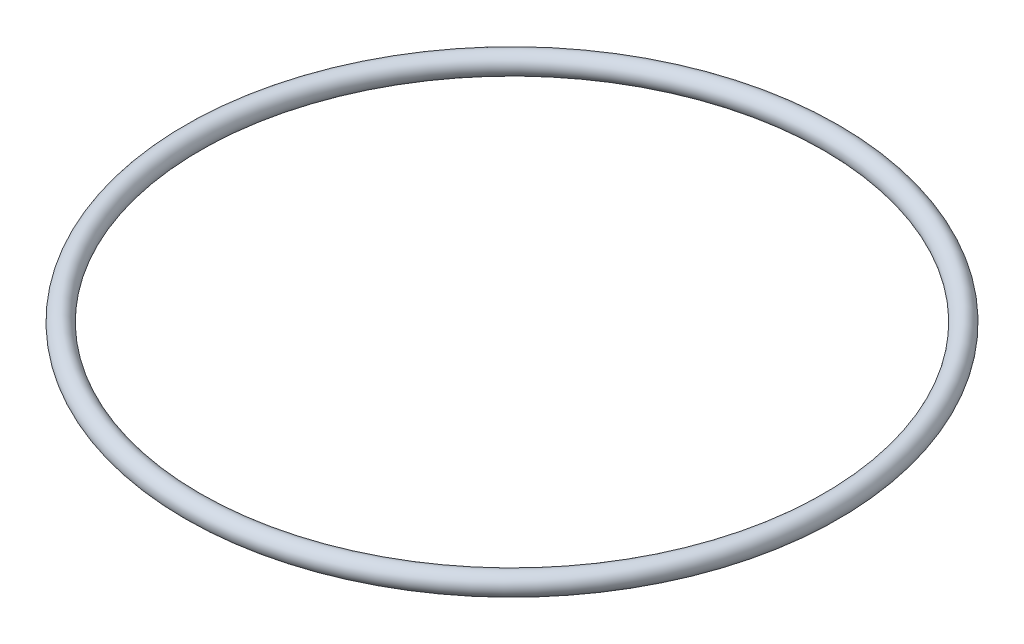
ISO-10303-21;
HEADER;
FILE_DESCRIPTION(('STEP AP214'),'2;1');
FILE_NAME('part.step','',(''),(''),'','','');
FILE_SCHEMA(('AUTOMOTIVE_DESIGN { 1 0 10303 214 1 1 1 1 }'));
ENDSEC;
DATA;
#1=APPLICATION_CONTEXT('core data for automotive mechanical design processes');
#2=APPLICATION_PROTOCOL_DEFINITION('international standard','automotive_design',2000,#1);
#3=PRODUCT_CONTEXT('',#1,'mechanical');
#4=PRODUCT('Part','Part','',(#3));
#5=PRODUCT_RELATED_PRODUCT_CATEGORY('part','',(#4));
#6=PRODUCT_DEFINITION_FORMATION('','',#4);
#7=PRODUCT_DEFINITION_CONTEXT('part definition',#1,'design');
#8=PRODUCT_DEFINITION('design','',#6,#7);
#9=PRODUCT_DEFINITION_SHAPE('','',#8);
#10=(LENGTH_UNIT() NAMED_UNIT(*) SI_UNIT(.MILLI.,.METRE.));
#11=(NAMED_UNIT(*) PLANE_ANGLE_UNIT() SI_UNIT($,.RADIAN.));
#12=(NAMED_UNIT(*) SI_UNIT($,.STERADIAN.) SOLID_ANGLE_UNIT());
#13=UNCERTAINTY_MEASURE_WITH_UNIT(LENGTH_MEASURE(1.E-05),#10,'distance_accuracy_value','');
#14=(GEOMETRIC_REPRESENTATION_CONTEXT(3) GLOBAL_UNCERTAINTY_ASSIGNED_CONTEXT((#13)) GLOBAL_UNIT_ASSIGNED_CONTEXT((#10,
#11,#12)) REPRESENTATION_CONTEXT('',''));
#15=CARTESIAN_POINT('',(0.,0.,0.));
#16=DIRECTION('',(0.,0.,1.));
#17=DIRECTION('',(1.,0.,0.));
#18=AXIS2_PLACEMENT_3D('',#15,#16,#17);
#19=CARTESIAN_POINT('',(0.,0.,0.));
#20=DIRECTION('',(0.,-1.,0.));
#21=DIRECTION('',(0.,0.,-1.));
#22=AXIS2_PLACEMENT_3D('',#19,#20,#21);
#23=TOROIDAL_SURFACE('',#22,96.85,3.15);
#24=CARTESIAN_POINT('',(0.,0.,-100.));
#25=VERTEX_POINT('',#24);
#26=VERTEX_LOOP('',#25);
#27=FACE_BOUND('',#26,.T.);
#28=ADVANCED_FACE('F29',(#27),#23,.T.);
#29=CLOSED_SHELL('',(#28));
#30=MANIFOLD_SOLID_BREP('B2',#29);
#31=ADVANCED_BREP_SHAPE_REPRESENTATION('',(#18,#30),#14);
#32=SHAPE_DEFINITION_REPRESENTATION(#9,#31);
ENDSEC;
END-ISO-10303-21;
